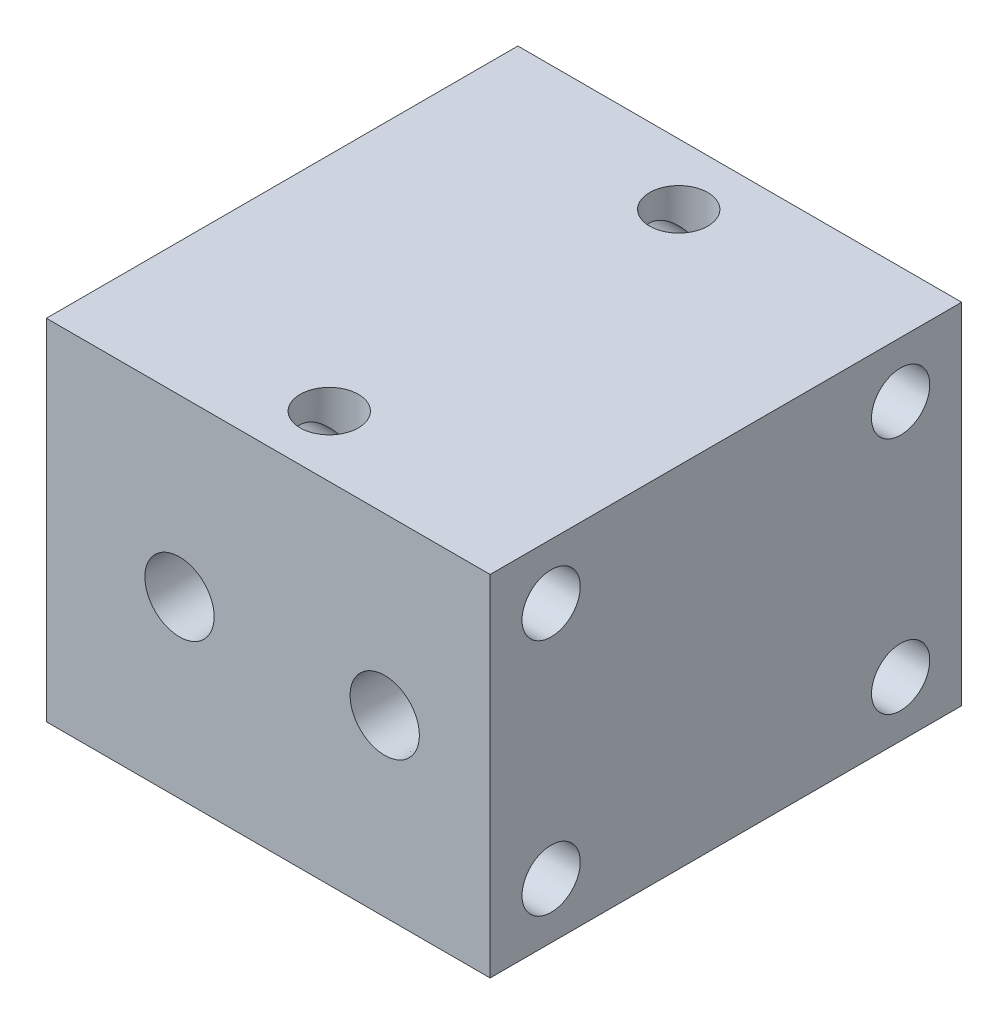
from build123d import *

# Parameters (mm, degrees)
SKETCH1_W                         = 80
SKETCH1_H                         = 85
SKETCH1_R                         = 5.25
EXTRUDE_H1_DEPTH                  = 63
SKETCH2_R                         = 0.5
CENTER_HOLE_DEPTH                 = 60
F_1_4_NPT_TAPPED_HOLE1_AT_2_COUNT = 2
F_1_4_NPT_TAPPED_HOLE1_AT_2_PITCH = 37
MTG_HOLE_REACH                    = 112.342
SKETCH6_R                         = 5.25
SKETCH5_R                         = 2
OIL_HOLE_DEPTH                    = 20


with BuildPart() as part:
    # Sketch1 → Extrude H1 (new body)
    with BuildSketch(Plane(origin=(0, 0, 0), x_dir=(1, 0, 0), z_dir=(0, 1, 0))):
        Rectangle(SKETCH1_W, SKETCH1_H)
        with Locations(Location((0, 31.5, 0), (0, 0, 270))):
            Circle(SKETCH1_R, mode=Mode.SUBTRACT)
        with Locations(Location((0, -31.5, 0), (0, 0, 270))):
            Circle(SKETCH1_R, mode=Mode.SUBTRACT)
    extrude(amount=EXTRUDE_H1_DEPTH)

    # Sketch2 → CENTER HOLE (cut)
    with BuildSketch(Plane.ZY.offset(40)):
        with Locations((0, 31.5)):
            Circle(SKETCH2_R)
    extrude(amount=-CENTER_HOLE_DEPTH, mode=Mode.SUBTRACT)

    # Sketch3 → 1_4 NPT Tapped Hole1 (revolve, cut)
    with BuildSketch(Plane(origin=(21, 31.5, 42.5), x_dir=(0, -1, 0), z_dir=(1, 0, 0))):
        Polygon((0, 0), (0, 20.412347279), (5.5626, 17.07), (5.5626, 10.02), (5.943676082, 10.02), (6.2436883, 0), align=None)
    f_1_4_npt_tapped_hole1 = revolve(axis=Axis((21, 31.5, 48.85), (0, 0, -1)), mode=Mode.SUBTRACT)

    # 1_4 NPT Tapped Hole1 at 2: 1_4 NPT Tapped Hole1 ×2
    with Locations(*[(-i * F_1_4_NPT_TAPPED_HOLE1_AT_2_PITCH, 0, 0) for i in range(1, F_1_4_NPT_TAPPED_HOLE1_AT_2_COUNT)]):
        add(f_1_4_npt_tapped_hole1, mode=Mode.SUBTRACT)

    # MTG HOLE: up to this face of the body (flat: up to its plane)
    mtg_hole_end = Plane(part.part.faces().sort_by_distance((40, 31.5, 0))[0])
    # Sketch6 → MTG HOLE (cut, up to the picked face)
    with BuildSketch(Plane.ZY.offset(40), mode=Mode.PRIVATE) as mtg_hole_sk1:
        with Locations((-31.5, 53)):
            Circle(SKETCH6_R)
    mtg_hole_tool1 = split(extrude(mtg_hole_sk1.sketch, amount=-MTG_HOLE_REACH, mode=Mode.PRIVATE), bisect_by=mtg_hole_end, keep=Keep.BOTH, mode=Mode.PRIVATE)
    # Sketch6 → MTG HOLE (cut, up to the picked face)
    with BuildSketch(Plane.ZY.offset(40), mode=Mode.PRIVATE) as mtg_hole_sk2:
        with Locations((-31.5, 10)):
            Circle(SKETCH6_R)
    mtg_hole_tool2 = split(extrude(mtg_hole_sk2.sketch, amount=-MTG_HOLE_REACH, mode=Mode.PRIVATE), bisect_by=mtg_hole_end, keep=Keep.BOTH, mode=Mode.PRIVATE)
    # Sketch6 → MTG HOLE (cut, up to the picked face)
    with BuildSketch(Plane.ZY.offset(40), mode=Mode.PRIVATE) as mtg_hole_sk3:
        with Locations((31.5, 53)):
            Circle(SKETCH6_R)
    mtg_hole_tool3 = split(extrude(mtg_hole_sk3.sketch, amount=-MTG_HOLE_REACH, mode=Mode.PRIVATE), bisect_by=mtg_hole_end, keep=Keep.BOTH, mode=Mode.PRIVATE)
    # Sketch6 → MTG HOLE (cut, up to the picked face)
    with BuildSketch(Plane.ZY.offset(40), mode=Mode.PRIVATE) as mtg_hole_sk4:
        with Locations((31.5, 10)):
            Circle(SKETCH6_R)
    mtg_hole_tool4 = split(extrude(mtg_hole_sk4.sketch, amount=-MTG_HOLE_REACH, mode=Mode.PRIVATE), bisect_by=mtg_hole_end, keep=Keep.BOTH, mode=Mode.PRIVATE)
    add(mtg_hole_tool1.solids().sort_by(Axis((-40, 53, -31.5), (1, 0, 0)))[0], mode=Mode.SUBTRACT)
    add(mtg_hole_tool2.solids().sort_by(Axis((-40, 10, -31.5), (1, 0, 0)))[0], mode=Mode.SUBTRACT)
    add(mtg_hole_tool3.solids().sort_by(Axis((-40, 53, 31.5), (1, 0, 0)))[0], mode=Mode.SUBTRACT)
    add(mtg_hole_tool4.solids().sort_by(Axis((-40, 10, 31.5), (1, 0, 0)))[0], mode=Mode.SUBTRACT)

    # Sketch5 → OIL HOLE (cut)
    with BuildSketch(Plane.XY.offset(42.5)):
        with Locations((-16, 31.5)):
            Circle(SKETCH5_R)
        with Locations((21, 31.5)):
            Circle(SKETCH5_R)
    extrude(amount=-OIL_HOLE_DEPTH, mode=Mode.SUBTRACT)


solid = part.part
